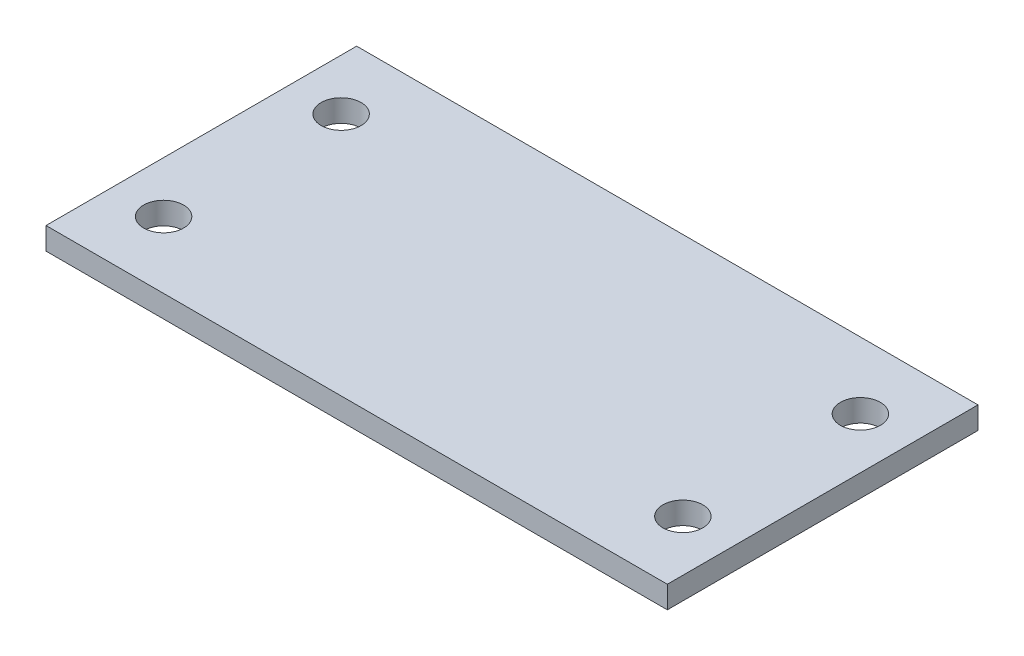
ISO-10303-21;
HEADER;
FILE_DESCRIPTION(('STEP AP214'),'2;1');
FILE_NAME('part.step','',(''),(''),'','','');
FILE_SCHEMA(('AUTOMOTIVE_DESIGN { 1 0 10303 214 1 1 1 1 }'));
ENDSEC;
DATA;
#1=APPLICATION_CONTEXT('core data for automotive mechanical design processes');
#2=APPLICATION_PROTOCOL_DEFINITION('international standard','automotive_design',2000,#1);
#3=PRODUCT_CONTEXT('',#1,'mechanical');
#4=PRODUCT('Part','Part','',(#3));
#5=PRODUCT_RELATED_PRODUCT_CATEGORY('part','',(#4));
#6=PRODUCT_DEFINITION_FORMATION('','',#4);
#7=PRODUCT_DEFINITION_CONTEXT('part definition',#1,'design');
#8=PRODUCT_DEFINITION('design','',#6,#7);
#9=PRODUCT_DEFINITION_SHAPE('','',#8);
#10=(LENGTH_UNIT() NAMED_UNIT(*) SI_UNIT(.MILLI.,.METRE.));
#11=(NAMED_UNIT(*) PLANE_ANGLE_UNIT() SI_UNIT($,.RADIAN.));
#12=(NAMED_UNIT(*) SI_UNIT($,.STERADIAN.) SOLID_ANGLE_UNIT());
#13=UNCERTAINTY_MEASURE_WITH_UNIT(LENGTH_MEASURE(1.E-05),#10,'distance_accuracy_value','');
#14=(GEOMETRIC_REPRESENTATION_CONTEXT(3) GLOBAL_UNCERTAINTY_ASSIGNED_CONTEXT((#13)) GLOBAL_UNIT_ASSIGNED_CONTEXT((#10,
#11,#12)) REPRESENTATION_CONTEXT('',''));
#15=CARTESIAN_POINT('',(0.,0.,0.));
#16=DIRECTION('',(0.,0.,1.));
#17=DIRECTION('',(1.,0.,0.));
#18=AXIS2_PLACEMENT_3D('',#15,#16,#17);
#19=CARTESIAN_POINT('',(64.25,0.,-7.5));
#20=DIRECTION('',(0.,1.,0.));
#21=DIRECTION('',(0.,0.,1.));
#22=AXIS2_PLACEMENT_3D('',#19,#20,#21);
#23=CYLINDRICAL_SURFACE('',#22,2.25);
#24=CARTESIAN_POINT('',(64.25,0.,-7.5));
#25=DIRECTION('',(0.,1.,0.));
#26=DIRECTION('',(0.,0.,1.));
#27=AXIS2_PLACEMENT_3D('',#24,#25,#26);
#28=CIRCLE('',#27,2.25);
#29=CARTESIAN_POINT('',(64.25,0.,-5.25));
#30=VERTEX_POINT('',#29);
#31=EDGE_CURVE('E48',#30,#30,#28,.T.);
#32=ORIENTED_EDGE('',*,*,#31,.F.);
#33=EDGE_LOOP('',(#32));
#34=FACE_BOUND('',#33,.T.);
#35=CARTESIAN_POINT('',(64.25,2.5,-7.5));
#36=DIRECTION('',(0.,1.,0.));
#37=DIRECTION('',(0.,0.,1.));
#38=AXIS2_PLACEMENT_3D('',#35,#36,#37);
#39=CIRCLE('',#38,2.25);
#40=CARTESIAN_POINT('',(64.25,2.5,-5.25));
#41=VERTEX_POINT('',#40);
#42=EDGE_CURVE('E11',#41,#41,#39,.T.);
#43=ORIENTED_EDGE('',*,*,#42,.T.);
#44=EDGE_LOOP('',(#43));
#45=FACE_BOUND('',#44,.T.);
#46=ADVANCED_FACE('F39',(#34,#45),#23,.F.);
#47=CARTESIAN_POINT('',(5.75,0.,-7.5));
#48=DIRECTION('',(0.,1.,0.));
#49=DIRECTION('',(0.,0.,1.));
#50=AXIS2_PLACEMENT_3D('',#47,#48,#49);
#51=CYLINDRICAL_SURFACE('',#50,2.25);
#52=CARTESIAN_POINT('',(5.75,0.,-7.5));
#53=DIRECTION('',(0.,1.,0.));
#54=DIRECTION('',(0.,0.,1.));
#55=AXIS2_PLACEMENT_3D('',#52,#53,#54);
#56=CIRCLE('',#55,2.25);
#57=CARTESIAN_POINT('',(5.75,0.,-5.25));
#58=VERTEX_POINT('',#57);
#59=EDGE_CURVE('E129',#58,#58,#56,.T.);
#60=ORIENTED_EDGE('',*,*,#59,.F.);
#61=EDGE_LOOP('',(#60));
#62=FACE_BOUND('',#61,.T.);
#63=CARTESIAN_POINT('',(5.75,2.5,-7.5));
#64=DIRECTION('',(0.,1.,0.));
#65=DIRECTION('',(0.,0.,1.));
#66=AXIS2_PLACEMENT_3D('',#63,#64,#65);
#67=CIRCLE('',#66,2.25);
#68=CARTESIAN_POINT('',(5.75,2.5,-5.25));
#69=VERTEX_POINT('',#68);
#70=EDGE_CURVE('E133',#69,#69,#67,.T.);
#71=ORIENTED_EDGE('',*,*,#70,.T.);
#72=EDGE_LOOP('',(#71));
#73=FACE_BOUND('',#72,.T.);
#74=ADVANCED_FACE('F144',(#62,#73),#51,.F.);
#75=CARTESIAN_POINT('',(0.,2.5,0.));
#76=DIRECTION('',(1.,0.,0.));
#77=DIRECTION('',(0.,0.,-1.));
#78=AXIS2_PLACEMENT_3D('',#75,#76,#77);
#79=PLANE('',#78);
#80=DIRECTION('',(0.,0.,1.));
#81=VECTOR('',#80,1.);
#82=CARTESIAN_POINT('',(0.,0.,0.));
#83=LINE('',#82,#81);
#84=CARTESIAN_POINT('',(0.,0.,-35.));
#85=VERTEX_POINT('',#84);
#86=CARTESIAN_POINT('',(0.,0.,0.));
#87=VERTEX_POINT('',#86);
#88=EDGE_CURVE('E112',#85,#87,#83,.T.);
#89=ORIENTED_EDGE('',*,*,#88,.T.);
#90=DIRECTION('',(0.,-1.,0.));
#91=VECTOR('',#90,1.);
#92=CARTESIAN_POINT('',(0.,2.5,0.));
#93=LINE('',#92,#91);
#94=CARTESIAN_POINT('',(0.,2.5,0.));
#95=VERTEX_POINT('',#94);
#96=EDGE_CURVE('E101',#95,#87,#93,.T.);
#97=ORIENTED_EDGE('',*,*,#96,.F.);
#98=DIRECTION('',(0.,0.,1.));
#99=VECTOR('',#98,1.);
#100=CARTESIAN_POINT('',(0.,2.5,0.));
#101=LINE('',#100,#99);
#102=CARTESIAN_POINT('',(0.,2.5,-35.));
#103=VERTEX_POINT('',#102);
#104=EDGE_CURVE('E93',#103,#95,#101,.T.);
#105=ORIENTED_EDGE('',*,*,#104,.F.);
#106=DIRECTION('',(0.,-1.,0.));
#107=VECTOR('',#106,1.);
#108=CARTESIAN_POINT('',(0.,2.5,-35.));
#109=LINE('',#108,#107);
#110=EDGE_CURVE('E108',#103,#85,#109,.T.);
#111=ORIENTED_EDGE('',*,*,#110,.T.);
#112=EDGE_LOOP('',(#89,#97,#105,#111));
#113=FACE_BOUND('',#112,.T.);
#114=ADVANCED_FACE('F168',(#113),#79,.F.);
#115=CARTESIAN_POINT('',(0.,2.5,0.));
#116=DIRECTION('',(0.,0.,-1.));
#117=DIRECTION('',(-1.,0.,0.));
#118=AXIS2_PLACEMENT_3D('',#115,#116,#117);
#119=PLANE('',#118);
#120=DIRECTION('',(1.,0.,0.));
#121=VECTOR('',#120,1.);
#122=CARTESIAN_POINT('',(0.,0.,0.));
#123=LINE('',#122,#121);
#124=CARTESIAN_POINT('',(70.,0.,0.));
#125=VERTEX_POINT('',#124);
#126=EDGE_CURVE('E99',#87,#125,#123,.T.);
#127=ORIENTED_EDGE('',*,*,#126,.T.);
#128=DIRECTION('',(0.,-1.,0.));
#129=VECTOR('',#128,1.);
#130=CARTESIAN_POINT('',(70.,2.5,0.));
#131=LINE('',#130,#129);
#132=CARTESIAN_POINT('',(70.,2.5,0.));
#133=VERTEX_POINT('',#132);
#134=EDGE_CURVE('E97',#133,#125,#131,.T.);
#135=ORIENTED_EDGE('',*,*,#134,.F.);
#136=DIRECTION('',(1.,0.,0.));
#137=VECTOR('',#136,1.);
#138=CARTESIAN_POINT('',(0.,2.5,0.));
#139=LINE('',#138,#137);
#140=EDGE_CURVE('E87',#95,#133,#139,.T.);
#141=ORIENTED_EDGE('',*,*,#140,.F.);
#142=ORIENTED_EDGE('',*,*,#96,.T.);
#143=EDGE_LOOP('',(#127,#135,#141,#142));
#144=FACE_BOUND('',#143,.T.);
#145=ADVANCED_FACE('F98',(#144),#119,.F.);
#146=CARTESIAN_POINT('',(70.,2.5,0.));
#147=DIRECTION('',(-1.,0.,0.));
#148=DIRECTION('',(0.,0.,1.));
#149=AXIS2_PLACEMENT_3D('',#146,#147,#148);
#150=PLANE('',#149);
#151=DIRECTION('',(0.,0.,-1.));
#152=VECTOR('',#151,1.);
#153=CARTESIAN_POINT('',(70.,0.,0.));
#154=LINE('',#153,#152);
#155=CARTESIAN_POINT('',(70.,0.,-35.));
#156=VERTEX_POINT('',#155);
#157=EDGE_CURVE('E73',#125,#156,#154,.T.);
#158=ORIENTED_EDGE('',*,*,#157,.T.);
#159=DIRECTION('',(0.,-1.,0.));
#160=VECTOR('',#159,1.);
#161=CARTESIAN_POINT('',(70.,2.5,-35.));
#162=LINE('',#161,#160);
#163=CARTESIAN_POINT('',(70.,2.5,-35.));
#164=VERTEX_POINT('',#163);
#165=EDGE_CURVE('E102',#164,#156,#162,.T.);
#166=ORIENTED_EDGE('',*,*,#165,.F.);
#167=DIRECTION('',(0.,0.,-1.));
#168=VECTOR('',#167,1.);
#169=CARTESIAN_POINT('',(70.,2.5,0.));
#170=LINE('',#169,#168);
#171=EDGE_CURVE('E91',#133,#164,#170,.T.);
#172=ORIENTED_EDGE('',*,*,#171,.F.);
#173=ORIENTED_EDGE('',*,*,#134,.T.);
#174=EDGE_LOOP('',(#158,#166,#172,#173));
#175=FACE_BOUND('',#174,.T.);
#176=ADVANCED_FACE('F104',(#175),#150,.F.);
#177=CARTESIAN_POINT('',(0.,2.5,-35.));
#178=DIRECTION('',(0.,0.,1.));
#179=DIRECTION('',(1.,0.,0.));
#180=AXIS2_PLACEMENT_3D('',#177,#178,#179);
#181=PLANE('',#180);
#182=DIRECTION('',(-1.,0.,0.));
#183=VECTOR('',#182,1.);
#184=CARTESIAN_POINT('',(0.,0.,-35.));
#185=LINE('',#184,#183);
#186=EDGE_CURVE('E79',#156,#85,#185,.T.);
#187=ORIENTED_EDGE('',*,*,#186,.T.);
#188=ORIENTED_EDGE('',*,*,#110,.F.);
#189=DIRECTION('',(-1.,0.,0.));
#190=VECTOR('',#189,1.);
#191=CARTESIAN_POINT('',(0.,2.5,-35.));
#192=LINE('',#191,#190);
#193=EDGE_CURVE('E56',#164,#103,#192,.T.);
#194=ORIENTED_EDGE('',*,*,#193,.F.);
#195=ORIENTED_EDGE('',*,*,#165,.T.);
#196=EDGE_LOOP('',(#187,#188,#194,#195));
#197=FACE_BOUND('',#196,.T.);
#198=ADVANCED_FACE('F148',(#197),#181,.F.);
#199=CARTESIAN_POINT('',(0.,2.5,0.));
#200=DIRECTION('',(0.,-1.,0.));
#201=DIRECTION('',(0.,0.,-1.));
#202=AXIS2_PLACEMENT_3D('',#199,#200,#201);
#203=PLANE('',#202);
#204=CARTESIAN_POINT('',(64.25,2.5,-27.5));
#205=DIRECTION('',(0.,1.,0.));
#206=DIRECTION('',(0.,0.,1.));
#207=AXIS2_PLACEMENT_3D('',#204,#205,#206);
#208=CIRCLE('',#207,2.25);
#209=CARTESIAN_POINT('',(64.25,2.5,-25.25));
#210=VERTEX_POINT('',#209);
#211=EDGE_CURVE('E239',#210,#210,#208,.T.);
#212=ORIENTED_EDGE('',*,*,#211,.F.);
#213=EDGE_LOOP('',(#212));
#214=FACE_BOUND('',#213,.T.);
#215=CARTESIAN_POINT('',(5.75,2.5,-27.5));
#216=DIRECTION('',(0.,1.,0.));
#217=DIRECTION('',(0.,0.,1.));
#218=AXIS2_PLACEMENT_3D('',#215,#216,#217);
#219=CIRCLE('',#218,2.25);
#220=CARTESIAN_POINT('',(5.75,2.5,-25.25));
#221=VERTEX_POINT('',#220);
#222=EDGE_CURVE('E241',#221,#221,#219,.T.);
#223=ORIENTED_EDGE('',*,*,#222,.F.);
#224=EDGE_LOOP('',(#223));
#225=FACE_BOUND('',#224,.T.);
#226=ORIENTED_EDGE('',*,*,#104,.T.);
#227=ORIENTED_EDGE('',*,*,#140,.T.);
#228=ORIENTED_EDGE('',*,*,#171,.T.);
#229=ORIENTED_EDGE('',*,*,#193,.T.);
#230=EDGE_LOOP('',(#226,#227,#228,#229));
#231=FACE_BOUND('',#230,.T.);
#232=ORIENTED_EDGE('',*,*,#70,.F.);
#233=EDGE_LOOP('',(#232));
#234=FACE_BOUND('',#233,.T.);
#235=ORIENTED_EDGE('',*,*,#42,.F.);
#236=EDGE_LOOP('',(#235));
#237=FACE_BOUND('',#236,.T.);
#238=ADVANCED_FACE('F88',(#214,#225,#231,#234,#237),#203,.F.);
#239=CARTESIAN_POINT('',(0.,0.,0.));
#240=DIRECTION('',(0.,-1.,0.));
#241=DIRECTION('',(0.,0.,-1.));
#242=AXIS2_PLACEMENT_3D('',#239,#240,#241);
#243=PLANE('',#242);
#244=CARTESIAN_POINT('',(64.25,0.,-27.5));
#245=DIRECTION('',(0.,1.,0.));
#246=DIRECTION('',(0.,0.,1.));
#247=AXIS2_PLACEMENT_3D('',#244,#245,#246);
#248=CIRCLE('',#247,2.25);
#249=CARTESIAN_POINT('',(64.25,0.,-25.25));
#250=VERTEX_POINT('',#249);
#251=EDGE_CURVE('E237',#250,#250,#248,.T.);
#252=ORIENTED_EDGE('',*,*,#251,.T.);
#253=EDGE_LOOP('',(#252));
#254=FACE_BOUND('',#253,.T.);
#255=CARTESIAN_POINT('',(5.75,0.,-27.5));
#256=DIRECTION('',(0.,1.,0.));
#257=DIRECTION('',(0.,0.,1.));
#258=AXIS2_PLACEMENT_3D('',#255,#256,#257);
#259=CIRCLE('',#258,2.25);
#260=CARTESIAN_POINT('',(5.75,0.,-25.25));
#261=VERTEX_POINT('',#260);
#262=EDGE_CURVE('E116',#261,#261,#259,.T.);
#263=ORIENTED_EDGE('',*,*,#262,.T.);
#264=EDGE_LOOP('',(#263));
#265=FACE_BOUND('',#264,.T.);
#266=ORIENTED_EDGE('',*,*,#88,.F.);
#267=ORIENTED_EDGE('',*,*,#186,.F.);
#268=ORIENTED_EDGE('',*,*,#157,.F.);
#269=ORIENTED_EDGE('',*,*,#126,.F.);
#270=EDGE_LOOP('',(#266,#267,#268,#269));
#271=FACE_BOUND('',#270,.T.);
#272=ORIENTED_EDGE('',*,*,#59,.T.);
#273=EDGE_LOOP('',(#272));
#274=FACE_BOUND('',#273,.T.);
#275=ORIENTED_EDGE('',*,*,#31,.T.);
#276=EDGE_LOOP('',(#275));
#277=FACE_BOUND('',#276,.T.);
#278=ADVANCED_FACE('F140',(#254,#265,#271,#274,#277),#243,.T.);
#279=CARTESIAN_POINT('',(5.75,0.,-27.5));
#280=DIRECTION('',(0.,1.,0.));
#281=DIRECTION('',(0.,0.,1.));
#282=AXIS2_PLACEMENT_3D('',#279,#280,#281);
#283=CYLINDRICAL_SURFACE('',#282,2.25);
#284=ORIENTED_EDGE('',*,*,#262,.F.);
#285=EDGE_LOOP('',(#284));
#286=FACE_BOUND('',#285,.T.);
#287=ORIENTED_EDGE('',*,*,#222,.T.);
#288=EDGE_LOOP('',(#287));
#289=FACE_BOUND('',#288,.T.);
#290=ADVANCED_FACE('F155',(#286,#289),#283,.F.);
#291=CARTESIAN_POINT('',(64.25,0.,-27.5));
#292=DIRECTION('',(0.,1.,0.));
#293=DIRECTION('',(0.,0.,1.));
#294=AXIS2_PLACEMENT_3D('',#291,#292,#293);
#295=CYLINDRICAL_SURFACE('',#294,2.25);
#296=ORIENTED_EDGE('',*,*,#251,.F.);
#297=EDGE_LOOP('',(#296));
#298=FACE_BOUND('',#297,.T.);
#299=ORIENTED_EDGE('',*,*,#211,.T.);
#300=EDGE_LOOP('',(#299));
#301=FACE_BOUND('',#300,.T.);
#302=ADVANCED_FACE('F206',(#298,#301),#295,.F.);
#303=CLOSED_SHELL('',(#46,#74,#114,#145,#176,#198,#238,#278,#290,#302));
#304=MANIFOLD_SOLID_BREP('B2',#303);
#305=ADVANCED_BREP_SHAPE_REPRESENTATION('',(#18,#304),#14);
#306=SHAPE_DEFINITION_REPRESENTATION(#9,#305);
ENDSEC;
END-ISO-10303-21;
